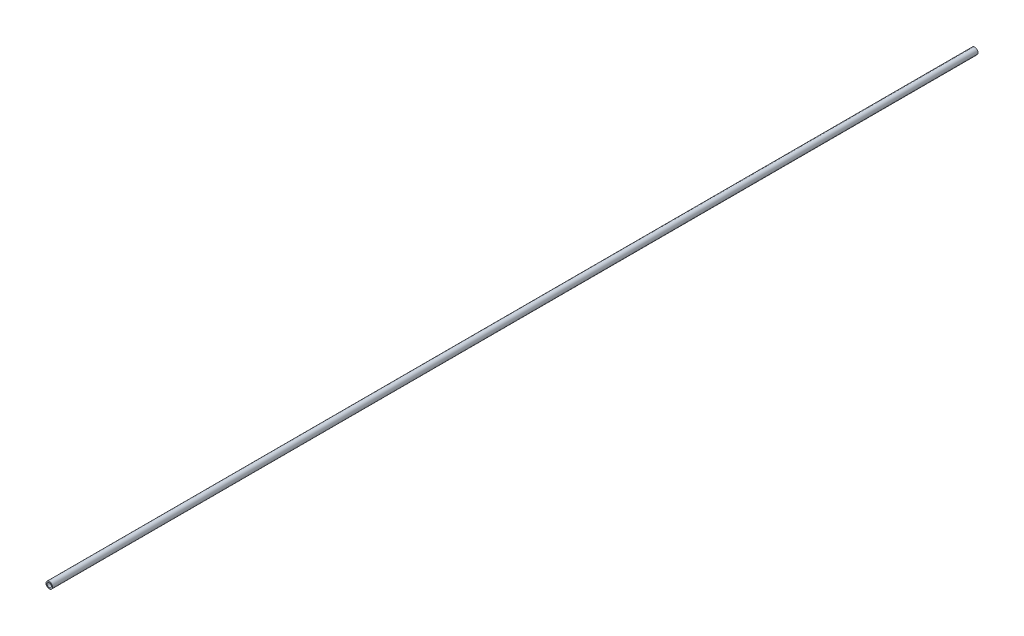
ISO-10303-21;
HEADER;
FILE_DESCRIPTION(('STEP AP214'),'2;1');
FILE_NAME('part.step','',(''),(''),'','','');
FILE_SCHEMA(('AUTOMOTIVE_DESIGN { 1 0 10303 214 1 1 1 1 }'));
ENDSEC;
DATA;
#1=APPLICATION_CONTEXT('core data for automotive mechanical design processes');
#2=APPLICATION_PROTOCOL_DEFINITION('international standard','automotive_design',2000,#1);
#3=PRODUCT_CONTEXT('',#1,'mechanical');
#4=PRODUCT('Part','Part','',(#3));
#5=PRODUCT_RELATED_PRODUCT_CATEGORY('part','',(#4));
#6=PRODUCT_DEFINITION_FORMATION('','',#4);
#7=PRODUCT_DEFINITION_CONTEXT('part definition',#1,'design');
#8=PRODUCT_DEFINITION('design','',#6,#7);
#9=PRODUCT_DEFINITION_SHAPE('','',#8);
#10=(LENGTH_UNIT() NAMED_UNIT(*) SI_UNIT(.MILLI.,.METRE.));
#11=(NAMED_UNIT(*) PLANE_ANGLE_UNIT() SI_UNIT($,.RADIAN.));
#12=(NAMED_UNIT(*) SI_UNIT($,.STERADIAN.) SOLID_ANGLE_UNIT());
#13=UNCERTAINTY_MEASURE_WITH_UNIT(LENGTH_MEASURE(1.E-05),#10,'distance_accuracy_value','');
#14=(GEOMETRIC_REPRESENTATION_CONTEXT(3) GLOBAL_UNCERTAINTY_ASSIGNED_CONTEXT((#13)) GLOBAL_UNIT_ASSIGNED_CONTEXT((#10,
#11,#12)) REPRESENTATION_CONTEXT('',''));
#15=CARTESIAN_POINT('',(0.,0.,0.));
#16=DIRECTION('',(0.,0.,1.));
#17=DIRECTION('',(1.,0.,0.));
#18=AXIS2_PLACEMENT_3D('',#15,#16,#17);
#19=CARTESIAN_POINT('',(0.,0.,3048.));
#20=DIRECTION('',(0.,0.,1.));
#21=DIRECTION('',(1.,0.,0.));
#22=AXIS2_PLACEMENT_3D('',#19,#20,#21);
#23=PLANE('',#22);
#24=CARTESIAN_POINT('',(0.,0.,3048.));
#25=DIRECTION('',(0.,0.,1.));
#26=DIRECTION('',(1.,0.,0.));
#27=AXIS2_PLACEMENT_3D('',#24,#25,#26);
#28=CIRCLE('',#27,10.668);
#29=CARTESIAN_POINT('',(10.668,0.,3048.));
#30=VERTEX_POINT('',#29);
#31=EDGE_CURVE('E10',#30,#30,#28,.T.);
#32=ORIENTED_EDGE('',*,*,#31,.T.);
#33=EDGE_LOOP('',(#32));
#34=FACE_BOUND('',#33,.T.);
#35=CARTESIAN_POINT('',(0.,0.,3048.));
#36=DIRECTION('',(0.,0.,1.));
#37=DIRECTION('',(1.,0.,0.));
#38=AXIS2_PLACEMENT_3D('',#35,#36,#37);
#39=CIRCLE('',#38,6.9342);
#40=CARTESIAN_POINT('',(6.9342,0.,3048.));
#41=VERTEX_POINT('',#40);
#42=EDGE_CURVE('E43',#41,#41,#39,.T.);
#43=ORIENTED_EDGE('',*,*,#42,.F.);
#44=EDGE_LOOP('',(#43));
#45=FACE_BOUND('',#44,.T.);
#46=ADVANCED_FACE('F32',(#34,#45),#23,.T.);
#47=CARTESIAN_POINT('',(0.,0.,0.));
#48=DIRECTION('',(0.,0.,1.));
#49=DIRECTION('',(1.,0.,0.));
#50=AXIS2_PLACEMENT_3D('',#47,#48,#49);
#51=PLANE('',#50);
#52=CARTESIAN_POINT('',(0.,0.,0.));
#53=DIRECTION('',(0.,0.,1.));
#54=DIRECTION('',(1.,0.,0.));
#55=AXIS2_PLACEMENT_3D('',#52,#53,#54);
#56=CIRCLE('',#55,10.668);
#57=CARTESIAN_POINT('',(10.668,0.,0.));
#58=VERTEX_POINT('',#57);
#59=EDGE_CURVE('E36',#58,#58,#56,.T.);
#60=ORIENTED_EDGE('',*,*,#59,.F.);
#61=EDGE_LOOP('',(#60));
#62=FACE_BOUND('',#61,.T.);
#63=CARTESIAN_POINT('',(0.,0.,0.));
#64=DIRECTION('',(0.,0.,1.));
#65=DIRECTION('',(1.,0.,0.));
#66=AXIS2_PLACEMENT_3D('',#63,#64,#65);
#67=CIRCLE('',#66,6.9342);
#68=CARTESIAN_POINT('',(6.9342,0.,0.));
#69=VERTEX_POINT('',#68);
#70=EDGE_CURVE('E45',#69,#69,#67,.T.);
#71=ORIENTED_EDGE('',*,*,#70,.T.);
#72=EDGE_LOOP('',(#71));
#73=FACE_BOUND('',#72,.T.);
#74=ADVANCED_FACE('F55',(#62,#73),#51,.F.);
#75=CARTESIAN_POINT('',(0.,0.,3048.));
#76=DIRECTION('',(0.,0.,-1.));
#77=DIRECTION('',(-1.,0.,0.));
#78=AXIS2_PLACEMENT_3D('',#75,#76,#77);
#79=CYLINDRICAL_SURFACE('',#78,10.668);
#80=ORIENTED_EDGE('',*,*,#31,.F.);
#81=EDGE_LOOP('',(#80));
#82=FACE_BOUND('',#81,.T.);
#83=ORIENTED_EDGE('',*,*,#59,.T.);
#84=EDGE_LOOP('',(#83));
#85=FACE_BOUND('',#84,.T.);
#86=ADVANCED_FACE('F34',(#82,#85),#79,.T.);
#87=CARTESIAN_POINT('',(0.,0.,3048.));
#88=DIRECTION('',(0.,0.,-1.));
#89=DIRECTION('',(-1.,0.,0.));
#90=AXIS2_PLACEMENT_3D('',#87,#88,#89);
#91=CYLINDRICAL_SURFACE('',#90,6.9342);
#92=ORIENTED_EDGE('',*,*,#42,.T.);
#93=EDGE_LOOP('',(#92));
#94=FACE_BOUND('',#93,.T.);
#95=ORIENTED_EDGE('',*,*,#70,.F.);
#96=EDGE_LOOP('',(#95));
#97=FACE_BOUND('',#96,.T.);
#98=ADVANCED_FACE('F51',(#94,#97),#91,.F.);
#99=CLOSED_SHELL('',(#46,#74,#86,#98));
#100=MANIFOLD_SOLID_BREP('B2',#99);
#101=ADVANCED_BREP_SHAPE_REPRESENTATION('',(#18,#100),#14);
#102=SHAPE_DEFINITION_REPRESENTATION(#9,#101);
ENDSEC;
END-ISO-10303-21;
